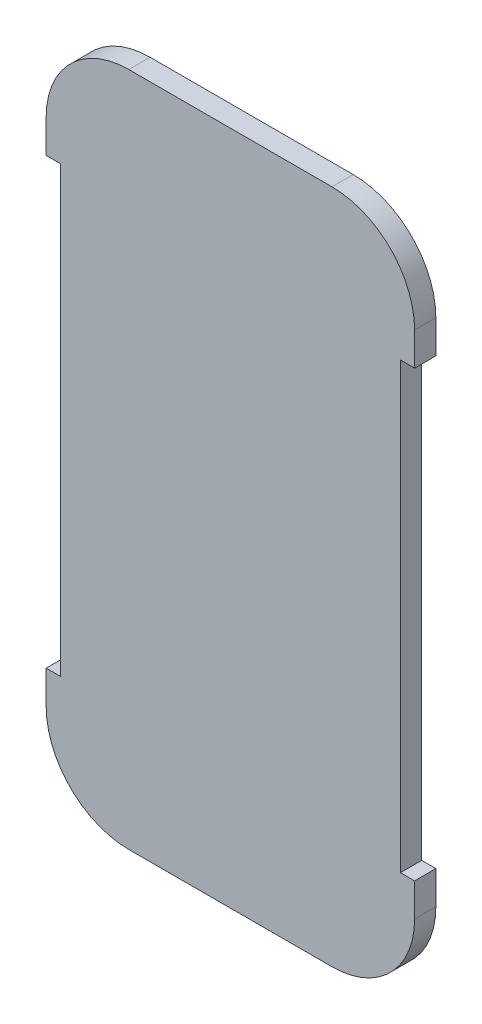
ISO-10303-21;
HEADER;
FILE_DESCRIPTION(('STEP AP214'),'2;1');
FILE_NAME('part.step','',(''),(''),'','','');
FILE_SCHEMA(('AUTOMOTIVE_DESIGN { 1 0 10303 214 1 1 1 1 }'));
ENDSEC;
DATA;
#1=APPLICATION_CONTEXT('core data for automotive mechanical design processes');
#2=APPLICATION_PROTOCOL_DEFINITION('international standard','automotive_design',2000,#1);
#3=PRODUCT_CONTEXT('',#1,'mechanical');
#4=PRODUCT('Part','Part','',(#3));
#5=PRODUCT_RELATED_PRODUCT_CATEGORY('part','',(#4));
#6=PRODUCT_DEFINITION_FORMATION('','',#4);
#7=PRODUCT_DEFINITION_CONTEXT('part definition',#1,'design');
#8=PRODUCT_DEFINITION('design','',#6,#7);
#9=PRODUCT_DEFINITION_SHAPE('','',#8);
#10=(LENGTH_UNIT() NAMED_UNIT(*) SI_UNIT(.MILLI.,.METRE.));
#11=(NAMED_UNIT(*) PLANE_ANGLE_UNIT() SI_UNIT($,.RADIAN.));
#12=(NAMED_UNIT(*) SI_UNIT($,.STERADIAN.) SOLID_ANGLE_UNIT());
#13=UNCERTAINTY_MEASURE_WITH_UNIT(LENGTH_MEASURE(1.E-05),#10,'distance_accuracy_value','');
#14=(GEOMETRIC_REPRESENTATION_CONTEXT(3) GLOBAL_UNCERTAINTY_ASSIGNED_CONTEXT((#13)) GLOBAL_UNIT_ASSIGNED_CONTEXT((#10,
#11,#12)) REPRESENTATION_CONTEXT('',''));
#15=CARTESIAN_POINT('',(0.,0.,0.));
#16=DIRECTION('',(0.,0.,1.));
#17=DIRECTION('',(1.,0.,0.));
#18=AXIS2_PLACEMENT_3D('',#15,#16,#17);
#19=CARTESIAN_POINT('',(55.7000000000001,305.8,5.09999999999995));
#20=DIRECTION('',(0.,0.,-0.999999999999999));
#21=DIRECTION('',(0.,1.,0.));
#22=AXIS2_PLACEMENT_3D('',#19,#20,#21);
#23=CYLINDRICAL_SURFACE('',#22,3.5);
#24=CARTESIAN_POINT('',(55.7000000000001,305.8,4.19999999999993));
#25=DIRECTION('',(0.,0.,-0.999999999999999));
#26=DIRECTION('',(0.,1.,0.));
#27=AXIS2_PLACEMENT_3D('',#24,#25,#26);
#28=CIRCLE('',#27,3.5);
#29=CARTESIAN_POINT('',(52.2000000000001,305.8,4.19999999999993));
#30=VERTEX_POINT('',#29);
#31=CARTESIAN_POINT('',(55.7000000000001,309.3,4.19999999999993));
#32=VERTEX_POINT('',#31);
#33=EDGE_CURVE('E177',#30,#32,#28,.T.);
#34=ORIENTED_EDGE('',*,*,#33,.F.);
#35=DIRECTION('',(0.,0.,-0.999999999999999));
#36=VECTOR('',#35,1.);
#37=CARTESIAN_POINT('',(52.2000000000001,305.8,5.09999999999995));
#38=LINE('',#37,#36);
#39=CARTESIAN_POINT('',(52.2000000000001,305.8,5.09999999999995));
#40=VERTEX_POINT('',#39);
#41=EDGE_CURVE('E11',#40,#30,#38,.T.);
#42=ORIENTED_EDGE('',*,*,#41,.F.);
#43=CARTESIAN_POINT('',(55.7000000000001,305.8,5.09999999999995));
#44=DIRECTION('',(0.,0.,-0.999999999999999));
#45=DIRECTION('',(0.,1.,0.));
#46=AXIS2_PLACEMENT_3D('',#43,#44,#45);
#47=CIRCLE('',#46,3.5);
#48=CARTESIAN_POINT('',(55.7000000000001,309.3,5.09999999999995));
#49=VERTEX_POINT('',#48);
#50=EDGE_CURVE('E221',#40,#49,#47,.T.);
#51=ORIENTED_EDGE('',*,*,#50,.T.);
#52=DIRECTION('',(0.,0.,-0.999999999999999));
#53=VECTOR('',#52,1.);
#54=CARTESIAN_POINT('',(55.7000000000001,309.3,5.09999999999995));
#55=LINE('',#54,#53);
#56=EDGE_CURVE('E35',#49,#32,#55,.T.);
#57=ORIENTED_EDGE('',*,*,#56,.T.);
#58=EDGE_LOOP('',(#34,#42,#51,#57));
#59=FACE_BOUND('',#58,.T.);
#60=ADVANCED_FACE('F32',(#59),#23,.T.);
#61=CARTESIAN_POINT('',(52.2000000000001,304.4,5.09999999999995));
#62=DIRECTION('',(-1.,0.,0.));
#63=DIRECTION('',(0.,0.,0.999999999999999));
#64=AXIS2_PLACEMENT_3D('',#61,#62,#63);
#65=PLANE('',#64);
#66=DIRECTION('',(0.,1.,0.));
#67=VECTOR('',#66,1.);
#68=CARTESIAN_POINT('',(52.2000000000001,304.4,4.19999999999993));
#69=LINE('',#68,#67);
#70=CARTESIAN_POINT('',(52.2000000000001,304.4,4.19999999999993));
#71=VERTEX_POINT('',#70);
#72=EDGE_CURVE('E219',#71,#30,#69,.T.);
#73=ORIENTED_EDGE('',*,*,#72,.F.);
#74=DIRECTION('',(0.,0.,-0.999999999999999));
#75=VECTOR('',#74,1.);
#76=CARTESIAN_POINT('',(52.2000000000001,304.4,5.09999999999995));
#77=LINE('',#76,#75);
#78=CARTESIAN_POINT('',(52.2000000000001,304.4,5.09999999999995));
#79=VERTEX_POINT('',#78);
#80=EDGE_CURVE('E41',#79,#71,#77,.T.);
#81=ORIENTED_EDGE('',*,*,#80,.F.);
#82=DIRECTION('',(0.,1.,0.));
#83=VECTOR('',#82,1.);
#84=CARTESIAN_POINT('',(52.2000000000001,304.4,5.09999999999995));
#85=LINE('',#84,#83);
#86=EDGE_CURVE('E167',#79,#40,#85,.T.);
#87=ORIENTED_EDGE('',*,*,#86,.T.);
#88=ORIENTED_EDGE('',*,*,#41,.T.);
#89=EDGE_LOOP('',(#73,#81,#87,#88));
#90=FACE_BOUND('',#89,.T.);
#91=ADVANCED_FACE('F249',(#90),#65,.T.);
#92=CARTESIAN_POINT('',(52.8000000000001,304.4,5.09999999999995));
#93=DIRECTION('',(0.,-1.,0.));
#94=DIRECTION('',(0.,0.,-0.999999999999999));
#95=AXIS2_PLACEMENT_3D('',#92,#93,#94);
#96=PLANE('',#95);
#97=DIRECTION('',(-1.,0.,0.));
#98=VECTOR('',#97,1.);
#99=CARTESIAN_POINT('',(52.8000000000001,304.4,4.19999999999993));
#100=LINE('',#99,#98);
#101=CARTESIAN_POINT('',(52.8000000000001,304.4,4.19999999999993));
#102=VERTEX_POINT('',#101);
#103=EDGE_CURVE('E154',#102,#71,#100,.T.);
#104=ORIENTED_EDGE('',*,*,#103,.F.);
#105=DIRECTION('',(0.,0.,-0.999999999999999));
#106=VECTOR('',#105,1.);
#107=CARTESIAN_POINT('',(52.8000000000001,304.4,5.09999999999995));
#108=LINE('',#107,#106);
#109=CARTESIAN_POINT('',(52.8000000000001,304.4,5.09999999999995));
#110=VERTEX_POINT('',#109);
#111=EDGE_CURVE('E149',#110,#102,#108,.T.);
#112=ORIENTED_EDGE('',*,*,#111,.F.);
#113=DIRECTION('',(-1.,0.,0.));
#114=VECTOR('',#113,1.);
#115=CARTESIAN_POINT('',(52.8000000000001,304.4,5.09999999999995));
#116=LINE('',#115,#114);
#117=EDGE_CURVE('E152',#110,#79,#116,.T.);
#118=ORIENTED_EDGE('',*,*,#117,.T.);
#119=ORIENTED_EDGE('',*,*,#80,.T.);
#120=EDGE_LOOP('',(#104,#112,#118,#119));
#121=FACE_BOUND('',#120,.T.);
#122=ADVANCED_FACE('F151',(#121),#96,.T.);
#123=CARTESIAN_POINT('',(52.8000000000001,285.6,5.09999999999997));
#124=DIRECTION('',(-1.,0.,0.));
#125=DIRECTION('',(0.,0.,0.999999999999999));
#126=AXIS2_PLACEMENT_3D('',#123,#124,#125);
#127=PLANE('',#126);
#128=DIRECTION('',(0.,1.,0.));
#129=VECTOR('',#128,1.);
#130=CARTESIAN_POINT('',(52.8000000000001,285.6,4.19999999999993));
#131=LINE('',#130,#129);
#132=CARTESIAN_POINT('',(52.8000000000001,285.6,4.19999999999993));
#133=VERTEX_POINT('',#132);
#134=EDGE_CURVE('E216',#133,#102,#131,.T.);
#135=ORIENTED_EDGE('',*,*,#134,.F.);
#136=DIRECTION('',(0.,0.,-0.999999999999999));
#137=VECTOR('',#136,1.);
#138=CARTESIAN_POINT('',(52.8000000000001,285.6,5.09999999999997));
#139=LINE('',#138,#137);
#140=CARTESIAN_POINT('',(52.8000000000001,285.6,5.09999999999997));
#141=VERTEX_POINT('',#140);
#142=EDGE_CURVE('E159',#141,#133,#139,.T.);
#143=ORIENTED_EDGE('',*,*,#142,.F.);
#144=DIRECTION('',(0.,1.,0.));
#145=VECTOR('',#144,1.);
#146=CARTESIAN_POINT('',(52.8000000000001,285.6,5.09999999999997));
#147=LINE('',#146,#145);
#148=EDGE_CURVE('E165',#141,#110,#147,.T.);
#149=ORIENTED_EDGE('',*,*,#148,.T.);
#150=ORIENTED_EDGE('',*,*,#111,.T.);
#151=EDGE_LOOP('',(#135,#143,#149,#150));
#152=FACE_BOUND('',#151,.T.);
#153=ADVANCED_FACE('F169',(#152),#127,.T.);
#154=CARTESIAN_POINT('',(52.2000000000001,285.6,5.09999999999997));
#155=DIRECTION('',(0.,1.,0.));
#156=DIRECTION('',(0.,0.,0.999999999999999));
#157=AXIS2_PLACEMENT_3D('',#154,#155,#156);
#158=PLANE('',#157);
#159=DIRECTION('',(1.,0.,0.));
#160=VECTOR('',#159,1.);
#161=CARTESIAN_POINT('',(52.2000000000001,285.6,4.19999999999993));
#162=LINE('',#161,#160);
#163=CARTESIAN_POINT('',(52.2000000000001,285.6,4.19999999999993));
#164=VERTEX_POINT('',#163);
#165=EDGE_CURVE('E213',#164,#133,#162,.T.);
#166=ORIENTED_EDGE('',*,*,#165,.F.);
#167=DIRECTION('',(0.,0.,-0.999999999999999));
#168=VECTOR('',#167,1.);
#169=CARTESIAN_POINT('',(52.2000000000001,285.6,5.09999999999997));
#170=LINE('',#169,#168);
#171=CARTESIAN_POINT('',(52.2000000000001,285.6,5.09999999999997));
#172=VERTEX_POINT('',#171);
#173=EDGE_CURVE('E225',#172,#164,#170,.T.);
#174=ORIENTED_EDGE('',*,*,#173,.F.);
#175=DIRECTION('',(1.,0.,0.));
#176=VECTOR('',#175,1.);
#177=CARTESIAN_POINT('',(52.2000000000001,285.6,5.09999999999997));
#178=LINE('',#177,#176);
#179=EDGE_CURVE('E170',#172,#141,#178,.T.);
#180=ORIENTED_EDGE('',*,*,#179,.T.);
#181=ORIENTED_EDGE('',*,*,#142,.T.);
#182=EDGE_LOOP('',(#166,#174,#180,#181));
#183=FACE_BOUND('',#182,.T.);
#184=ADVANCED_FACE('F262',(#183),#158,.T.);
#185=CARTESIAN_POINT('',(52.2000000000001,284.2,5.09999999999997));
#186=DIRECTION('',(-1.,0.,0.));
#187=DIRECTION('',(0.,0.,0.999999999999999));
#188=AXIS2_PLACEMENT_3D('',#185,#186,#187);
#189=PLANE('',#188);
#190=DIRECTION('',(0.,1.,0.));
#191=VECTOR('',#190,1.);
#192=CARTESIAN_POINT('',(52.2000000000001,284.2,4.19999999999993));
#193=LINE('',#192,#191);
#194=CARTESIAN_POINT('',(52.2000000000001,284.2,4.19999999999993));
#195=VERTEX_POINT('',#194);
#196=EDGE_CURVE('E210',#195,#164,#193,.T.);
#197=ORIENTED_EDGE('',*,*,#196,.F.);
#198=DIRECTION('',(0.,0.,-0.999999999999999));
#199=VECTOR('',#198,1.);
#200=CARTESIAN_POINT('',(52.2000000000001,284.2,5.09999999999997));
#201=LINE('',#200,#199);
#202=CARTESIAN_POINT('',(52.2000000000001,284.2,5.09999999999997));
#203=VERTEX_POINT('',#202);
#204=EDGE_CURVE('E227',#203,#195,#201,.T.);
#205=ORIENTED_EDGE('',*,*,#204,.F.);
#206=DIRECTION('',(0.,1.,0.));
#207=VECTOR('',#206,1.);
#208=CARTESIAN_POINT('',(52.2000000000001,284.2,5.09999999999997));
#209=LINE('',#208,#207);
#210=EDGE_CURVE('E172',#203,#172,#209,.T.);
#211=ORIENTED_EDGE('',*,*,#210,.T.);
#212=ORIENTED_EDGE('',*,*,#173,.T.);
#213=EDGE_LOOP('',(#197,#205,#211,#212));
#214=FACE_BOUND('',#213,.T.);
#215=ADVANCED_FACE('F265',(#214),#189,.T.);
#216=CARTESIAN_POINT('',(55.7000000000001,284.2,5.09999999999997));
#217=DIRECTION('',(0.,0.,-0.999999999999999));
#218=DIRECTION('',(0.,1.,0.));
#219=AXIS2_PLACEMENT_3D('',#216,#217,#218);
#220=CYLINDRICAL_SURFACE('',#219,3.5);
#221=CARTESIAN_POINT('',(55.7000000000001,284.2,4.19999999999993));
#222=DIRECTION('',(0.,0.,-0.999999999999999));
#223=DIRECTION('',(0.,1.,0.));
#224=AXIS2_PLACEMENT_3D('',#221,#222,#223);
#225=CIRCLE('',#224,3.5);
#226=CARTESIAN_POINT('',(55.7000000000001,280.7,4.19999999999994));
#227=VERTEX_POINT('',#226);
#228=EDGE_CURVE('E207',#227,#195,#225,.T.);
#229=ORIENTED_EDGE('',*,*,#228,.F.);
#230=DIRECTION('',(0.,0.,-0.999999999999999));
#231=VECTOR('',#230,1.);
#232=CARTESIAN_POINT('',(55.7000000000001,280.7,5.09999999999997));
#233=LINE('',#232,#231);
#234=CARTESIAN_POINT('',(55.7000000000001,280.7,5.09999999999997));
#235=VERTEX_POINT('',#234);
#236=EDGE_CURVE('E229',#235,#227,#233,.T.);
#237=ORIENTED_EDGE('',*,*,#236,.F.);
#238=CARTESIAN_POINT('',(55.7000000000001,284.2,5.09999999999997));
#239=DIRECTION('',(0.,0.,-0.999999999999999));
#240=DIRECTION('',(0.,1.,0.));
#241=AXIS2_PLACEMENT_3D('',#238,#239,#240);
#242=CIRCLE('',#241,3.5);
#243=EDGE_CURVE('E446',#235,#203,#242,.T.);
#244=ORIENTED_EDGE('',*,*,#243,.T.);
#245=ORIENTED_EDGE('',*,*,#204,.T.);
#246=EDGE_LOOP('',(#229,#237,#244,#245));
#247=FACE_BOUND('',#246,.T.);
#248=ADVANCED_FACE('F269',(#247),#220,.T.);
#249=CARTESIAN_POINT('',(64.3000000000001,280.7,5.09999999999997));
#250=DIRECTION('',(0.,-1.,0.));
#251=DIRECTION('',(0.,0.,-0.999999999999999));
#252=AXIS2_PLACEMENT_3D('',#249,#250,#251);
#253=PLANE('',#252);
#254=DIRECTION('',(-1.,0.,0.));
#255=VECTOR('',#254,1.);
#256=CARTESIAN_POINT('',(64.3000000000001,280.7,4.19999999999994));
#257=LINE('',#256,#255);
#258=CARTESIAN_POINT('',(64.3000000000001,280.7,4.19999999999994));
#259=VERTEX_POINT('',#258);
#260=EDGE_CURVE('E204',#259,#227,#257,.T.);
#261=ORIENTED_EDGE('',*,*,#260,.F.);
#262=DIRECTION('',(0.,0.,-0.999999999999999));
#263=VECTOR('',#262,1.);
#264=CARTESIAN_POINT('',(64.3000000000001,280.7,5.09999999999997));
#265=LINE('',#264,#263);
#266=CARTESIAN_POINT('',(64.3000000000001,280.7,5.09999999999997));
#267=VERTEX_POINT('',#266);
#268=EDGE_CURVE('E231',#267,#259,#265,.T.);
#269=ORIENTED_EDGE('',*,*,#268,.F.);
#270=DIRECTION('',(-1.,0.,0.));
#271=VECTOR('',#270,1.);
#272=CARTESIAN_POINT('',(64.3000000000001,280.7,5.09999999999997));
#273=LINE('',#272,#271);
#274=EDGE_CURVE('E442',#267,#235,#273,.T.);
#275=ORIENTED_EDGE('',*,*,#274,.T.);
#276=ORIENTED_EDGE('',*,*,#236,.T.);
#277=EDGE_LOOP('',(#261,#269,#275,#276));
#278=FACE_BOUND('',#277,.T.);
#279=ADVANCED_FACE('F273',(#278),#253,.T.);
#280=CARTESIAN_POINT('',(64.3000000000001,284.2,5.09999999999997));
#281=DIRECTION('',(0.,0.,-0.999999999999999));
#282=DIRECTION('',(0.,1.,0.));
#283=AXIS2_PLACEMENT_3D('',#280,#281,#282);
#284=CYLINDRICAL_SURFACE('',#283,3.5);
#285=CARTESIAN_POINT('',(64.3000000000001,284.2,4.19999999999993));
#286=DIRECTION('',(0.,0.,-0.999999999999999));
#287=DIRECTION('',(0.,1.,0.));
#288=AXIS2_PLACEMENT_3D('',#285,#286,#287);
#289=CIRCLE('',#288,3.5);
#290=CARTESIAN_POINT('',(67.8000000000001,284.2,4.19999999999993));
#291=VERTEX_POINT('',#290);
#292=EDGE_CURVE('E201',#291,#259,#289,.T.);
#293=ORIENTED_EDGE('',*,*,#292,.F.);
#294=DIRECTION('',(0.,0.,-0.999999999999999));
#295=VECTOR('',#294,1.);
#296=CARTESIAN_POINT('',(67.8000000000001,284.2,5.09999999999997));
#297=LINE('',#296,#295);
#298=CARTESIAN_POINT('',(67.8000000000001,284.2,5.09999999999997));
#299=VERTEX_POINT('',#298);
#300=EDGE_CURVE('E233',#299,#291,#297,.T.);
#301=ORIENTED_EDGE('',*,*,#300,.F.);
#302=CARTESIAN_POINT('',(64.3000000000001,284.2,5.09999999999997));
#303=DIRECTION('',(0.,0.,-0.999999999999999));
#304=DIRECTION('',(0.,1.,0.));
#305=AXIS2_PLACEMENT_3D('',#302,#303,#304);
#306=CIRCLE('',#305,3.5);
#307=EDGE_CURVE('E453',#299,#267,#306,.T.);
#308=ORIENTED_EDGE('',*,*,#307,.T.);
#309=ORIENTED_EDGE('',*,*,#268,.T.);
#310=EDGE_LOOP('',(#293,#301,#308,#309));
#311=FACE_BOUND('',#310,.T.);
#312=ADVANCED_FACE('F277',(#311),#284,.T.);
#313=CARTESIAN_POINT('',(67.8000000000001,285.6,5.09999999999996));
#314=DIRECTION('',(1.,0.,0.));
#315=DIRECTION('',(0.,0.,-0.999999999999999));
#316=AXIS2_PLACEMENT_3D('',#313,#314,#315);
#317=PLANE('',#316);
#318=DIRECTION('',(0.,-1.,0.));
#319=VECTOR('',#318,1.);
#320=CARTESIAN_POINT('',(67.8000000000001,285.6,4.19999999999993));
#321=LINE('',#320,#319);
#322=CARTESIAN_POINT('',(67.8000000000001,285.6,4.19999999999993));
#323=VERTEX_POINT('',#322);
#324=EDGE_CURVE('E198',#323,#291,#321,.T.);
#325=ORIENTED_EDGE('',*,*,#324,.F.);
#326=DIRECTION('',(0.,0.,-0.999999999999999));
#327=VECTOR('',#326,1.);
#328=CARTESIAN_POINT('',(67.8000000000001,285.6,5.09999999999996));
#329=LINE('',#328,#327);
#330=CARTESIAN_POINT('',(67.8000000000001,285.6,5.09999999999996));
#331=VERTEX_POINT('',#330);
#332=EDGE_CURVE('E235',#331,#323,#329,.T.);
#333=ORIENTED_EDGE('',*,*,#332,.F.);
#334=DIRECTION('',(0.,-1.,0.));
#335=VECTOR('',#334,1.);
#336=CARTESIAN_POINT('',(67.8000000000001,285.6,5.09999999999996));
#337=LINE('',#336,#335);
#338=EDGE_CURVE('E435',#331,#299,#337,.T.);
#339=ORIENTED_EDGE('',*,*,#338,.T.);
#340=ORIENTED_EDGE('',*,*,#300,.T.);
#341=EDGE_LOOP('',(#325,#333,#339,#340));
#342=FACE_BOUND('',#341,.T.);
#343=ADVANCED_FACE('F281',(#342),#317,.T.);
#344=CARTESIAN_POINT('',(67.2000000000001,285.6,5.09999999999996));
#345=DIRECTION('',(0.,1.,0.));
#346=DIRECTION('',(0.,0.,0.999999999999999));
#347=AXIS2_PLACEMENT_3D('',#344,#345,#346);
#348=PLANE('',#347);
#349=DIRECTION('',(1.,0.,0.));
#350=VECTOR('',#349,1.);
#351=CARTESIAN_POINT('',(67.2000000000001,285.6,4.19999999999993));
#352=LINE('',#351,#350);
#353=CARTESIAN_POINT('',(67.2000000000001,285.6,4.19999999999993));
#354=VERTEX_POINT('',#353);
#355=EDGE_CURVE('E195',#354,#323,#352,.T.);
#356=ORIENTED_EDGE('',*,*,#355,.F.);
#357=DIRECTION('',(0.,0.,-0.999999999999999));
#358=VECTOR('',#357,1.);
#359=CARTESIAN_POINT('',(67.2000000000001,285.6,5.09999999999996));
#360=LINE('',#359,#358);
#361=CARTESIAN_POINT('',(67.2000000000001,285.6,5.09999999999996));
#362=VERTEX_POINT('',#361);
#363=EDGE_CURVE('E237',#362,#354,#360,.T.);
#364=ORIENTED_EDGE('',*,*,#363,.F.);
#365=DIRECTION('',(1.,0.,0.));
#366=VECTOR('',#365,1.);
#367=CARTESIAN_POINT('',(67.2000000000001,285.6,5.09999999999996));
#368=LINE('',#367,#366);
#369=EDGE_CURVE('E431',#362,#331,#368,.T.);
#370=ORIENTED_EDGE('',*,*,#369,.T.);
#371=ORIENTED_EDGE('',*,*,#332,.T.);
#372=EDGE_LOOP('',(#356,#364,#370,#371));
#373=FACE_BOUND('',#372,.T.);
#374=ADVANCED_FACE('F285',(#373),#348,.T.);
#375=CARTESIAN_POINT('',(67.2000000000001,304.4,5.09999999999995));
#376=DIRECTION('',(1.,0.,0.));
#377=DIRECTION('',(0.,0.,-0.999999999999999));
#378=AXIS2_PLACEMENT_3D('',#375,#376,#377);
#379=PLANE('',#378);
#380=DIRECTION('',(0.,-1.,0.));
#381=VECTOR('',#380,1.);
#382=CARTESIAN_POINT('',(67.2000000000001,304.4,4.19999999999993));
#383=LINE('',#382,#381);
#384=CARTESIAN_POINT('',(67.2000000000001,304.4,4.19999999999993));
#385=VERTEX_POINT('',#384);
#386=EDGE_CURVE('E192',#385,#354,#383,.T.);
#387=ORIENTED_EDGE('',*,*,#386,.F.);
#388=DIRECTION('',(0.,0.,-0.999999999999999));
#389=VECTOR('',#388,1.);
#390=CARTESIAN_POINT('',(67.2000000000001,304.4,5.09999999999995));
#391=LINE('',#390,#389);
#392=CARTESIAN_POINT('',(67.2000000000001,304.4,5.09999999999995));
#393=VERTEX_POINT('',#392);
#394=EDGE_CURVE('E239',#393,#385,#391,.T.);
#395=ORIENTED_EDGE('',*,*,#394,.F.);
#396=DIRECTION('',(0.,-1.,0.));
#397=VECTOR('',#396,1.);
#398=CARTESIAN_POINT('',(67.2000000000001,304.4,5.09999999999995));
#399=LINE('',#398,#397);
#400=EDGE_CURVE('E457',#393,#362,#399,.T.);
#401=ORIENTED_EDGE('',*,*,#400,.T.);
#402=ORIENTED_EDGE('',*,*,#363,.T.);
#403=EDGE_LOOP('',(#387,#395,#401,#402));
#404=FACE_BOUND('',#403,.T.);
#405=ADVANCED_FACE('F289',(#404),#379,.T.);
#406=CARTESIAN_POINT('',(67.8000000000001,304.4,5.09999999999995));
#407=DIRECTION('',(0.,-1.,0.));
#408=DIRECTION('',(0.,0.,-0.999999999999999));
#409=AXIS2_PLACEMENT_3D('',#406,#407,#408);
#410=PLANE('',#409);
#411=DIRECTION('',(-1.,0.,0.));
#412=VECTOR('',#411,1.);
#413=CARTESIAN_POINT('',(67.8000000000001,304.4,4.19999999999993));
#414=LINE('',#413,#412);
#415=CARTESIAN_POINT('',(67.8000000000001,304.4,4.19999999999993));
#416=VERTEX_POINT('',#415);
#417=EDGE_CURVE('E189',#416,#385,#414,.T.);
#418=ORIENTED_EDGE('',*,*,#417,.F.);
#419=DIRECTION('',(0.,0.,-0.999999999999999));
#420=VECTOR('',#419,1.);
#421=CARTESIAN_POINT('',(67.8000000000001,304.4,5.09999999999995));
#422=LINE('',#421,#420);
#423=CARTESIAN_POINT('',(67.8000000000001,304.4,5.09999999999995));
#424=VERTEX_POINT('',#423);
#425=EDGE_CURVE('E241',#424,#416,#422,.T.);
#426=ORIENTED_EDGE('',*,*,#425,.F.);
#427=DIRECTION('',(-1.,0.,0.));
#428=VECTOR('',#427,1.);
#429=CARTESIAN_POINT('',(67.8000000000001,304.4,5.09999999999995));
#430=LINE('',#429,#428);
#431=EDGE_CURVE('E424',#424,#393,#430,.T.);
#432=ORIENTED_EDGE('',*,*,#431,.T.);
#433=ORIENTED_EDGE('',*,*,#394,.T.);
#434=EDGE_LOOP('',(#418,#426,#432,#433));
#435=FACE_BOUND('',#434,.T.);
#436=ADVANCED_FACE('F293',(#435),#410,.T.);
#437=CARTESIAN_POINT('',(67.8000000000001,305.8,5.09999999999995));
#438=DIRECTION('',(1.,0.,0.));
#439=DIRECTION('',(0.,0.,-0.999999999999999));
#440=AXIS2_PLACEMENT_3D('',#437,#438,#439);
#441=PLANE('',#440);
#442=DIRECTION('',(0.,-1.,0.));
#443=VECTOR('',#442,1.);
#444=CARTESIAN_POINT('',(67.8000000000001,305.8,4.19999999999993));
#445=LINE('',#444,#443);
#446=CARTESIAN_POINT('',(67.8000000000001,305.8,4.19999999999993));
#447=VERTEX_POINT('',#446);
#448=EDGE_CURVE('E186',#447,#416,#445,.T.);
#449=ORIENTED_EDGE('',*,*,#448,.F.);
#450=DIRECTION('',(0.,0.,-0.999999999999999));
#451=VECTOR('',#450,1.);
#452=CARTESIAN_POINT('',(67.8000000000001,305.8,5.09999999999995));
#453=LINE('',#452,#451);
#454=CARTESIAN_POINT('',(67.8000000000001,305.8,5.09999999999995));
#455=VERTEX_POINT('',#454);
#456=EDGE_CURVE('E243',#455,#447,#453,.T.);
#457=ORIENTED_EDGE('',*,*,#456,.F.);
#458=DIRECTION('',(0.,-1.,0.));
#459=VECTOR('',#458,1.);
#460=CARTESIAN_POINT('',(67.8000000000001,305.8,5.09999999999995));
#461=LINE('',#460,#459);
#462=EDGE_CURVE('E420',#455,#424,#461,.T.);
#463=ORIENTED_EDGE('',*,*,#462,.T.);
#464=ORIENTED_EDGE('',*,*,#425,.T.);
#465=EDGE_LOOP('',(#449,#457,#463,#464));
#466=FACE_BOUND('',#465,.T.);
#467=ADVANCED_FACE('F297',(#466),#441,.T.);
#468=CARTESIAN_POINT('',(64.3000000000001,305.8,5.09999999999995));
#469=DIRECTION('',(0.,0.,-0.999999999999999));
#470=DIRECTION('',(0.,1.,0.));
#471=AXIS2_PLACEMENT_3D('',#468,#469,#470);
#472=CYLINDRICAL_SURFACE('',#471,3.5);
#473=CARTESIAN_POINT('',(64.3000000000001,305.8,4.19999999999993));
#474=DIRECTION('',(0.,0.,-0.999999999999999));
#475=DIRECTION('',(0.,1.,0.));
#476=AXIS2_PLACEMENT_3D('',#473,#474,#475);
#477=CIRCLE('',#476,3.5);
#478=CARTESIAN_POINT('',(64.3000000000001,309.3,4.19999999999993));
#479=VERTEX_POINT('',#478);
#480=EDGE_CURVE('E183',#479,#447,#477,.T.);
#481=ORIENTED_EDGE('',*,*,#480,.F.);
#482=DIRECTION('',(0.,0.,-0.999999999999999));
#483=VECTOR('',#482,1.);
#484=CARTESIAN_POINT('',(64.3000000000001,309.3,5.09999999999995));
#485=LINE('',#484,#483);
#486=CARTESIAN_POINT('',(64.3000000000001,309.3,5.09999999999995));
#487=VERTEX_POINT('',#486);
#488=EDGE_CURVE('E244',#487,#479,#485,.T.);
#489=ORIENTED_EDGE('',*,*,#488,.F.);
#490=CARTESIAN_POINT('',(64.3000000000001,305.8,5.09999999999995));
#491=DIRECTION('',(0.,0.,-0.999999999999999));
#492=DIRECTION('',(0.,1.,0.));
#493=AXIS2_PLACEMENT_3D('',#490,#491,#492);
#494=CIRCLE('',#493,3.5);
#495=EDGE_CURVE('E461',#487,#455,#494,.T.);
#496=ORIENTED_EDGE('',*,*,#495,.T.);
#497=ORIENTED_EDGE('',*,*,#456,.T.);
#498=EDGE_LOOP('',(#481,#489,#496,#497));
#499=FACE_BOUND('',#498,.T.);
#500=ADVANCED_FACE('F301',(#499),#472,.T.);
#501=CARTESIAN_POINT('',(55.7000000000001,309.3,5.09999999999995));
#502=DIRECTION('',(0.,1.,0.));
#503=DIRECTION('',(0.,0.,0.999999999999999));
#504=AXIS2_PLACEMENT_3D('',#501,#502,#503);
#505=PLANE('',#504);
#506=DIRECTION('',(1.,0.,0.));
#507=VECTOR('',#506,1.);
#508=CARTESIAN_POINT('',(55.7000000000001,309.3,4.19999999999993));
#509=LINE('',#508,#507);
#510=EDGE_CURVE('E180',#32,#479,#509,.T.);
#511=ORIENTED_EDGE('',*,*,#510,.F.);
#512=ORIENTED_EDGE('',*,*,#56,.F.);
#513=DIRECTION('',(1.,0.,0.));
#514=VECTOR('',#513,1.);
#515=CARTESIAN_POINT('',(55.7000000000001,309.3,5.09999999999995));
#516=LINE('',#515,#514);
#517=EDGE_CURVE('E463',#49,#487,#516,.T.);
#518=ORIENTED_EDGE('',*,*,#517,.T.);
#519=ORIENTED_EDGE('',*,*,#488,.T.);
#520=EDGE_LOOP('',(#511,#512,#518,#519));
#521=FACE_BOUND('',#520,.T.);
#522=ADVANCED_FACE('F246',(#521),#505,.T.);
#523=CARTESIAN_POINT('',(55.7000000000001,305.8,5.09999999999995));
#524=DIRECTION('',(0.,0.,-0.999999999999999));
#525=DIRECTION('',(0.,1.,0.));
#526=AXIS2_PLACEMENT_3D('',#523,#524,#525);
#527=PLANE('',#526);
#528=ORIENTED_EDGE('',*,*,#50,.F.);
#529=ORIENTED_EDGE('',*,*,#86,.F.);
#530=ORIENTED_EDGE('',*,*,#117,.F.);
#531=ORIENTED_EDGE('',*,*,#148,.F.);
#532=ORIENTED_EDGE('',*,*,#179,.F.);
#533=ORIENTED_EDGE('',*,*,#210,.F.);
#534=ORIENTED_EDGE('',*,*,#243,.F.);
#535=ORIENTED_EDGE('',*,*,#274,.F.);
#536=ORIENTED_EDGE('',*,*,#307,.F.);
#537=ORIENTED_EDGE('',*,*,#338,.F.);
#538=ORIENTED_EDGE('',*,*,#369,.F.);
#539=ORIENTED_EDGE('',*,*,#400,.F.);
#540=ORIENTED_EDGE('',*,*,#431,.F.);
#541=ORIENTED_EDGE('',*,*,#462,.F.);
#542=ORIENTED_EDGE('',*,*,#495,.F.);
#543=ORIENTED_EDGE('',*,*,#517,.F.);
#544=EDGE_LOOP('',(#528,#529,#530,#531,#532,#533,#534,#535,#536,#537,#538,#539,#540,#541,#542,#543));
#545=FACE_BOUND('',#544,.T.);
#546=ADVANCED_FACE('F163',(#545),#527,.F.);
#547=CARTESIAN_POINT('',(55.7000000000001,305.8,4.19999999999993));
#548=DIRECTION('',(0.,0.,-0.999999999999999));
#549=DIRECTION('',(0.,1.,0.));
#550=AXIS2_PLACEMENT_3D('',#547,#548,#549);
#551=PLANE('',#550);
#552=ORIENTED_EDGE('',*,*,#33,.T.);
#553=ORIENTED_EDGE('',*,*,#510,.T.);
#554=ORIENTED_EDGE('',*,*,#480,.T.);
#555=ORIENTED_EDGE('',*,*,#448,.T.);
#556=ORIENTED_EDGE('',*,*,#417,.T.);
#557=ORIENTED_EDGE('',*,*,#386,.T.);
#558=ORIENTED_EDGE('',*,*,#355,.T.);
#559=ORIENTED_EDGE('',*,*,#324,.T.);
#560=ORIENTED_EDGE('',*,*,#292,.T.);
#561=ORIENTED_EDGE('',*,*,#260,.T.);
#562=ORIENTED_EDGE('',*,*,#228,.T.);
#563=ORIENTED_EDGE('',*,*,#196,.T.);
#564=ORIENTED_EDGE('',*,*,#165,.T.);
#565=ORIENTED_EDGE('',*,*,#134,.T.);
#566=ORIENTED_EDGE('',*,*,#103,.T.);
#567=ORIENTED_EDGE('',*,*,#72,.T.);
#568=EDGE_LOOP('',(#552,#553,#554,#555,#556,#557,#558,#559,#560,#561,#562,#563,#564,#565,#566,#567));
#569=FACE_BOUND('',#568,.T.);
#570=ADVANCED_FACE('F248',(#569),#551,.T.);
#571=CLOSED_SHELL('',(#60,#91,#122,#153,#184,#215,#248,#279,#312,#343,#374,#405,#436,#467,#500,
#522,#546,#570));
#572=MANIFOLD_SOLID_BREP('B2',#571);
#573=ADVANCED_BREP_SHAPE_REPRESENTATION('',(#18,#572),#14);
#574=SHAPE_DEFINITION_REPRESENTATION(#9,#573);
ENDSEC;
END-ISO-10303-21;
